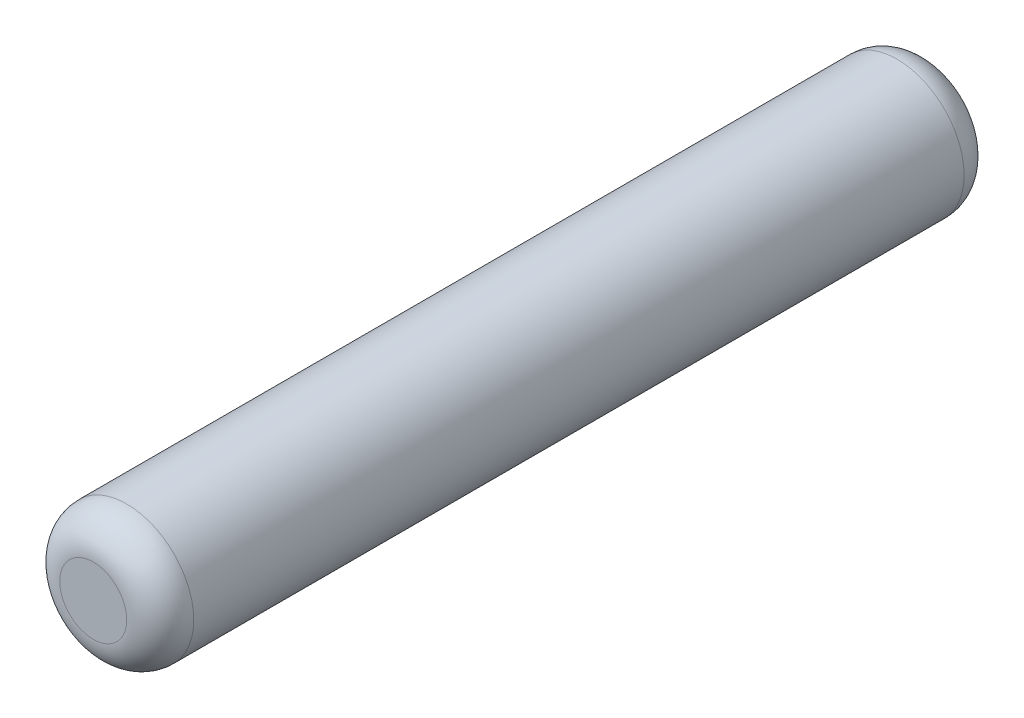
from build123d import *

# Parameters (mm, degrees)
SKETCH_1_R      = 2
EXTRUDE_1_DEPTH = 12.5
FILLET_1_R      = 1


with BuildPart() as part:
    # Sketch 1 → Extrude 1 (new, symmetric)
    with BuildSketch(Plane.XY):
        Circle(SKETCH_1_R)
    extrude(amount=EXTRUDE_1_DEPTH, both=True)

    # Fillet 1
    fillet_1_edges = [part.edges().sort_by_distance(p)[0] for p in [
        (-2, 0, -12.5),
        (-2, 0, 12.5),
    ]]
    fillet(fillet_1_edges, radius=FILLET_1_R)


solid = part.part
